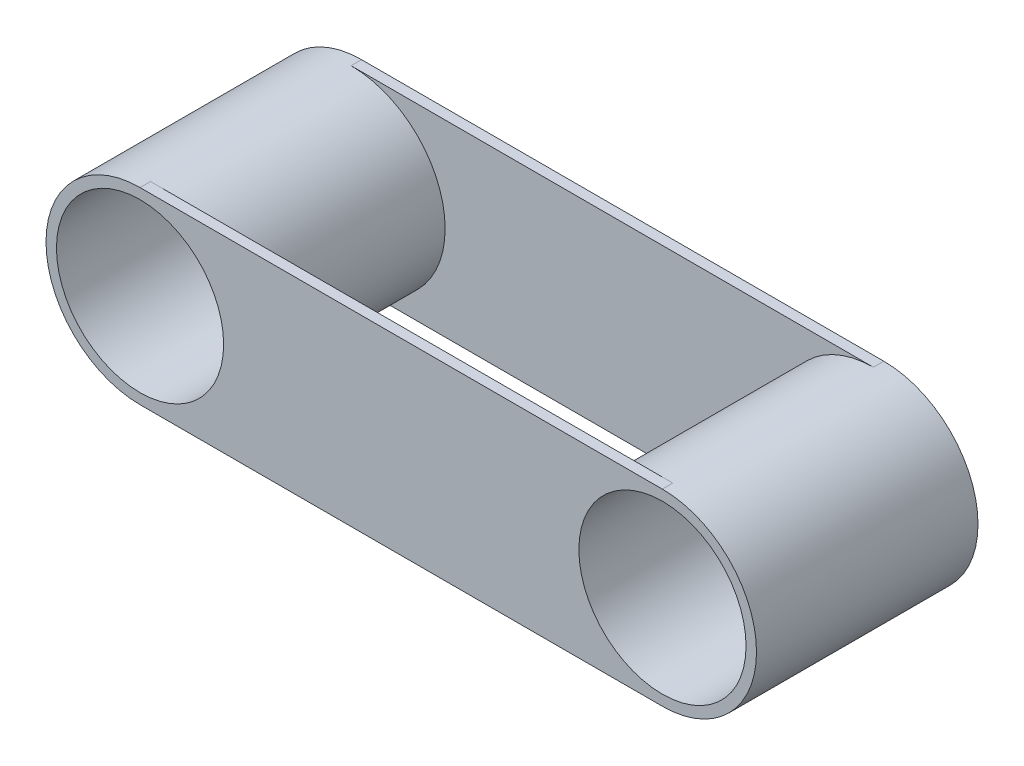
from build123d import *

# Parameters (mm, degrees)
SKETCH1_R               = 90
SKETCH1_R_2             = 80
BOSS_EXTRUDE1_DEPTH     = 106
BOSS_EXTRUDE2_DEPTH     = 10
CUT_EXTRUDE1_DEPTH      = 631.082534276
CUT_EXTRUDE1_DEPTH_BACK = 631.082534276


with BuildPart() as part:
    # Sketch1 → Boss-Extrude1 (new, symmetric)
    with BuildSketch(Plane.XY):
        Circle(SKETCH1_R)
        Circle(SKETCH1_R_2, mode=Mode.SUBTRACT)
    boss_extrude1 = extrude(amount=BOSS_EXTRUDE1_DEPTH, both=True)

    # Sketch2 → Boss-Extrude2 (add)
    with BuildSketch(Plane.XY.offset(106)):
        with BuildLine():
            Line((0, 90), (499.88, 90))
            Line((499.88, 90), (499.88, -90))
            Line((499.88, -90), (0, -90))
            ThreePointArc((0, -90), (90, 0), (0, 90))
        make_face()
    boss_extrude2 = extrude(amount=-BOSS_EXTRUDE2_DEPTH)

    # Mirror1: Boss-Extrude2 across plane
    add(boss_extrude2.mirror(Plane.XY))

    # Mirror2: Boss-Extrude1 across plane
    add(boss_extrude1.mirror(Plane(origin=(250, 0, 0), x_dir=(0, 0, 1), z_dir=(1, 0, 0))))

    # Sketch3 → Cut-Extrude1 (cut, two sides: drawn at the far end of the back side and taken through both)
    with BuildSketch(Plane.XY.offset(-96).offset(-CUT_EXTRUDE1_DEPTH_BACK)):
        with BuildLine():
            Line((499.88, -79.99991), (499.88, 79.99991))
            ThreePointArc((499.88, 79.99991), (420, 0), (499.88, -79.99991))
        make_face()
    extrude(amount=CUT_EXTRUDE1_DEPTH + CUT_EXTRUDE1_DEPTH_BACK, mode=Mode.SUBTRACT)


solid = part.part
